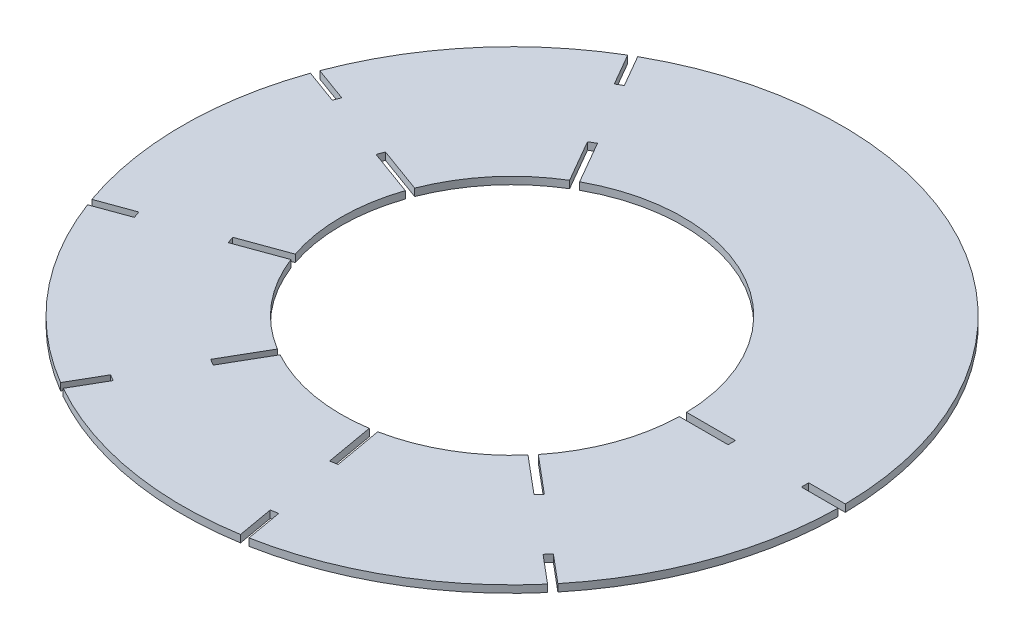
from build123d import *

# Parameters (mm, degrees)
SKETCH1_R           = 675
SKETCH1_R_2         = 350
BOSS_EXTRUDE1_DEPTH = 15
SKETCH2_W           = 100
SKETCH2_H           = 15
SKETCH2_W_2         = 105
CUT_EXTRUDE3_DEPTH  = 15


with BuildPart() as part:
    # Sketch1 → Boss-Extrude1 (new body)
    with BuildSketch(Plane(origin=(0, 0, 0), x_dir=(1, 0, 0), z_dir=(0, 1, 0))):
        with Locations(Location((0, 0, 0), (0, 0, 270))):
            Circle(SKETCH1_R)
        with Locations(Location((0, 0, 0), (0, 0, 270))):
            Circle(SKETCH1_R_2, mode=Mode.SUBTRACT)
    extrude(amount=BOSS_EXTRUDE1_DEPTH)

    # Sketch2 → Cut-Extrude3 (cut)
    with BuildSketch(Plane(origin=(0, 15, 0), x_dir=(1, 0, 0), z_dir=(0, 1, 0))):
        with Locations((650, 0)):
            Rectangle(SKETCH2_W, SKETCH2_H)
        with Locations((397.5, 0)):
            Rectangle(SKETCH2_W_2, SKETCH2_H)
        Polygon((111.574964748, -589.582290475), (128.939782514, -688.063065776), (114.167666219, -690.667788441), (96.802848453, -592.18701314), align=None)
        Polygon((67.294679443, -338.456313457), (85.527738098, -441.861127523), (70.755621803, -444.465850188), (52.522563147, -341.061036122), align=None)
        Polygon((464.447572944, -379.927232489), (541.052017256, -444.205993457), (531.410203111, -455.696660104), (454.805758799, -391.417899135), align=None)
        Polygon((269.106239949, -216.016392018), (349.540906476, -283.509091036), (339.899092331, -294.999757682), (259.464425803, -227.507058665), align=None)
        Polygon((-293.504809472, -523.365242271), (-343.504809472, -609.967782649), (-356.495190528, -602.467782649), (-306.495190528, -515.865242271), align=None)
        Polygon((-166.004809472, -302.528764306), (-218.504809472, -393.461431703), (-231.495190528, -385.961431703), (-178.995190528, -295.028764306), align=None)
        Polygon((-561.250421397, -212.259780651), (-655.219683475, -246.461794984), (-660.349985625, -232.366405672), (-566.380723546, -198.16439134), align=None)
        Polygon((-321.628803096, -125.044644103), (-420.296528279, -160.956759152), (-425.426830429, -146.861369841), (-326.759105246, -110.949254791), align=None)
        Polygon((-566.380723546, 198.16439134), (-660.349985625, 232.366405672), (-655.219683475, 246.461794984), (-561.250421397, 212.259780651), align=None)
        Polygon((-326.759105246, 110.949254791), (-425.426830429, 146.861369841), (-420.296528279, 160.956759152), (-321.628803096, 125.044644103), align=None)
        Polygon((-306.495190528, 515.865242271), (-356.495190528, 602.467782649), (-343.504809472, 609.967782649), (-293.504809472, 523.365242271), align=None)
        Polygon((-178.995190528, 295.028764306), (-231.495190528, 385.961431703), (-218.504809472, 393.461431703), (-166.004809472, 302.528764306), align=None)
    extrude(amount=-CUT_EXTRUDE3_DEPTH, mode=Mode.SUBTRACT)


solid = part.part
